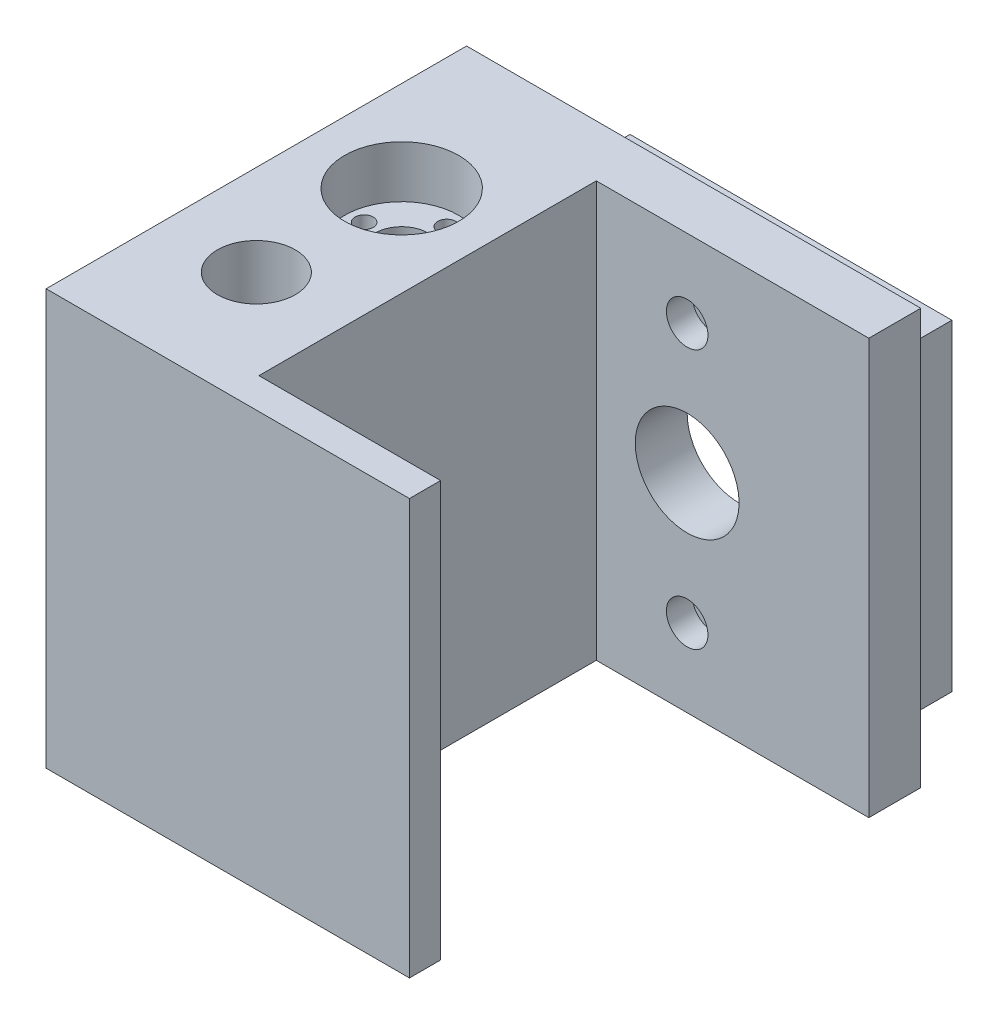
ISO-10303-21;
HEADER;
FILE_DESCRIPTION(('STEP AP214'),'2;1');
FILE_NAME('part.step','',(''),(''),'','','');
FILE_SCHEMA(('AUTOMOTIVE_DESIGN { 1 0 10303 214 1 1 1 1 }'));
ENDSEC;
DATA;
#1=APPLICATION_CONTEXT('core data for automotive mechanical design processes');
#2=APPLICATION_PROTOCOL_DEFINITION('international standard','automotive_design',2000,#1);
#3=PRODUCT_CONTEXT('',#1,'mechanical');
#4=PRODUCT('Part','Part','',(#3));
#5=PRODUCT_RELATED_PRODUCT_CATEGORY('part','',(#4));
#6=PRODUCT_DEFINITION_FORMATION('','',#4);
#7=PRODUCT_DEFINITION_CONTEXT('part definition',#1,'design');
#8=PRODUCT_DEFINITION('design','',#6,#7);
#9=PRODUCT_DEFINITION_SHAPE('','',#8);
#10=(LENGTH_UNIT() NAMED_UNIT(*) SI_UNIT(.MILLI.,.METRE.));
#11=(NAMED_UNIT(*) PLANE_ANGLE_UNIT() SI_UNIT($,.RADIAN.));
#12=(NAMED_UNIT(*) SI_UNIT($,.STERADIAN.) SOLID_ANGLE_UNIT());
#13=UNCERTAINTY_MEASURE_WITH_UNIT(LENGTH_MEASURE(1.E-05),#10,'distance_accuracy_value','');
#14=(GEOMETRIC_REPRESENTATION_CONTEXT(3) GLOBAL_UNCERTAINTY_ASSIGNED_CONTEXT((#13)) GLOBAL_UNIT_ASSIGNED_CONTEXT((#10,
#11,#12)) REPRESENTATION_CONTEXT('',''));
#15=CARTESIAN_POINT('',(0.,0.,0.));
#16=DIRECTION('',(0.,0.,1.));
#17=DIRECTION('',(1.,0.,0.));
#18=AXIS2_PLACEMENT_3D('',#15,#16,#17);
#19=CARTESIAN_POINT('',(0.,168.069574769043,-10.));
#20=DIRECTION('',(0.,0.,1.));
#21=DIRECTION('',(1.,0.,0.));
#22=AXIS2_PLACEMENT_3D('',#19,#20,#21);
#23=PLANE('',#22);
#24=DIRECTION('',(0.,-1.,0.));
#25=VECTOR('',#24,1.);
#26=CARTESIAN_POINT('',(0.,168.069574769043,-10.));
#27=LINE('',#26,#25);
#28=CARTESIAN_POINT('',(0.,80.,-10.));
#29=VERTEX_POINT('',#28);
#30=CARTESIAN_POINT('',(0.,0.,-10.));
#31=VERTEX_POINT('',#30);
#32=EDGE_CURVE('E305',#29,#31,#27,.T.);
#33=ORIENTED_EDGE('',*,*,#32,.F.);
#34=DIRECTION('',(1.,0.,0.));
#35=VECTOR('',#34,1.);
#36=CARTESIAN_POINT('',(0.,80.,-10.));
#37=LINE('',#36,#35);
#38=CARTESIAN_POINT('',(87.5,80.,-10.));
#39=VERTEX_POINT('',#38);
#40=EDGE_CURVE('E296',#29,#39,#37,.T.);
#41=ORIENTED_EDGE('',*,*,#40,.T.);
#42=DIRECTION('',(0.,-1.,0.));
#43=VECTOR('',#42,1.);
#44=CARTESIAN_POINT('',(87.5,168.069574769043,-10.));
#45=LINE('',#44,#43);
#46=CARTESIAN_POINT('',(87.5,0.,-10.));
#47=VERTEX_POINT('',#46);
#48=EDGE_CURVE('E303',#39,#47,#45,.T.);
#49=ORIENTED_EDGE('',*,*,#48,.T.);
#50=DIRECTION('',(-1.,0.,0.));
#51=VECTOR('',#50,1.);
#52=CARTESIAN_POINT('',(0.,0.,-10.));
#53=LINE('',#52,#51);
#54=EDGE_CURVE('E308',#47,#31,#53,.T.);
#55=ORIENTED_EDGE('',*,*,#54,.T.);
#56=EDGE_LOOP('',(#33,#41,#49,#55));
#57=FACE_BOUND('',#56,.T.);
#58=DIRECTION('',(0.,-1.,0.));
#59=VECTOR('',#58,1.);
#60=CARTESIAN_POINT('',(83.5,9.00000000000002,-10.));
#61=LINE('',#60,#59);
#62=CARTESIAN_POINT('',(83.5,71.,-10.));
#63=VERTEX_POINT('',#62);
#64=CARTESIAN_POINT('',(83.5,9.00000000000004,-10.));
#65=VERTEX_POINT('',#64);
#66=EDGE_CURVE('E185',#63,#65,#61,.T.);
#67=ORIENTED_EDGE('',*,*,#66,.F.);
#68=DIRECTION('',(1.,0.,0.));
#69=VECTOR('',#68,1.);
#70=CARTESIAN_POINT('',(83.5,71.,-10.));
#71=LINE('',#70,#69);
#72=CARTESIAN_POINT('',(21.5,71.,-10.));
#73=VERTEX_POINT('',#72);
#74=EDGE_CURVE('E213',#73,#63,#71,.T.);
#75=ORIENTED_EDGE('',*,*,#74,.F.);
#76=DIRECTION('',(0.,1.,0.));
#77=VECTOR('',#76,1.);
#78=CARTESIAN_POINT('',(21.5,71.,-10.));
#79=LINE('',#78,#77);
#80=CARTESIAN_POINT('',(21.5,9.00000000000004,-10.));
#81=VERTEX_POINT('',#80);
#82=EDGE_CURVE('E75',#81,#73,#79,.T.);
#83=ORIENTED_EDGE('',*,*,#82,.F.);
#84=DIRECTION('',(-1.,0.,0.));
#85=VECTOR('',#84,1.);
#86=CARTESIAN_POINT('',(21.5,9.00000000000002,-10.));
#87=LINE('',#86,#85);
#88=EDGE_CURVE('E70',#65,#81,#87,.T.);
#89=ORIENTED_EDGE('',*,*,#88,.F.);
#90=EDGE_LOOP('',(#67,#75,#83,#89));
#91=FACE_BOUND('',#90,.T.);
#92=ADVANCED_FACE('F53',(#57,#91),#23,.F.);
#93=CARTESIAN_POINT('',(35.,0.,65.));
#94=DIRECTION('',(0.,1.,0.));
#95=DIRECTION('',(0.,0.,1.));
#96=AXIS2_PLACEMENT_3D('',#93,#94,#95);
#97=PLANE('',#96);
#98=CARTESIAN_POINT('',(17.5,0.,48.));
#99=DIRECTION('',(0.,1.,0.));
#100=DIRECTION('',(0.,0.,1.));
#101=AXIS2_PLACEMENT_3D('',#98,#99,#100);
#102=CIRCLE('',#101,4.);
#103=CARTESIAN_POINT('',(17.5,0.,52.));
#104=VERTEX_POINT('',#103);
#105=EDGE_CURVE('E236',#104,#104,#102,.T.);
#106=ORIENTED_EDGE('',*,*,#105,.T.);
#107=EDGE_LOOP('',(#106));
#108=FACE_BOUND('',#107,.T.);
#109=CARTESIAN_POINT('',(17.5,0.,20.));
#110=DIRECTION('',(0.,1.,0.));
#111=DIRECTION('',(0.,0.,1.));
#112=AXIS2_PLACEMENT_3D('',#109,#110,#111);
#113=CIRCLE('',#112,5.10000000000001);
#114=CARTESIAN_POINT('',(17.5,0.,25.1));
#115=VERTEX_POINT('',#114);
#116=EDGE_CURVE('E327',#115,#115,#113,.T.);
#117=ORIENTED_EDGE('',*,*,#116,.T.);
#118=EDGE_LOOP('',(#117));
#119=FACE_BOUND('',#118,.T.);
#120=DIRECTION('',(0.,0.,-1.));
#121=VECTOR('',#120,1.);
#122=CARTESIAN_POINT('',(0.,0.,65.));
#123=LINE('',#122,#121);
#124=CARTESIAN_POINT('',(0.,0.,71.));
#125=VERTEX_POINT('',#124);
#126=EDGE_CURVE('E360',#125,#31,#123,.T.);
#127=ORIENTED_EDGE('',*,*,#126,.T.);
#128=ORIENTED_EDGE('',*,*,#54,.F.);
#129=DIRECTION('',(0.,0.,-1.));
#130=VECTOR('',#129,1.);
#131=CARTESIAN_POINT('',(87.5,0.,0.));
#132=LINE('',#131,#130);
#133=CARTESIAN_POINT('',(87.5,0.,0.));
#134=VERTEX_POINT('',#133);
#135=EDGE_CURVE('E311',#134,#47,#132,.T.);
#136=ORIENTED_EDGE('',*,*,#135,.F.);
#137=DIRECTION('',(1.,0.,0.));
#138=VECTOR('',#137,1.);
#139=CARTESIAN_POINT('',(0.,0.,0.));
#140=LINE('',#139,#138);
#141=CARTESIAN_POINT('',(35.,0.,0.));
#142=VERTEX_POINT('',#141);
#143=EDGE_CURVE('E314',#142,#134,#140,.T.);
#144=ORIENTED_EDGE('',*,*,#143,.F.);
#145=DIRECTION('',(0.,0.,-1.));
#146=VECTOR('',#145,1.);
#147=CARTESIAN_POINT('',(35.,0.,65.));
#148=LINE('',#147,#146);
#149=CARTESIAN_POINT('',(35.,0.,65.));
#150=VERTEX_POINT('',#149);
#151=EDGE_CURVE('E364',#150,#142,#148,.T.);
#152=ORIENTED_EDGE('',*,*,#151,.F.);
#153=DIRECTION('',(-1.,0.,0.));
#154=VECTOR('',#153,1.);
#155=CARTESIAN_POINT('',(0.,0.,65.));
#156=LINE('',#155,#154);
#157=CARTESIAN_POINT('',(70.,0.,65.));
#158=VERTEX_POINT('',#157);
#159=EDGE_CURVE('E333',#158,#150,#156,.T.);
#160=ORIENTED_EDGE('',*,*,#159,.F.);
#161=DIRECTION('',(0.,0.,-1.));
#162=VECTOR('',#161,1.);
#163=CARTESIAN_POINT('',(70.,0.,65.));
#164=LINE('',#163,#162);
#165=CARTESIAN_POINT('',(70.,0.,71.));
#166=VERTEX_POINT('',#165);
#167=EDGE_CURVE('E330',#166,#158,#164,.T.);
#168=ORIENTED_EDGE('',*,*,#167,.F.);
#169=DIRECTION('',(1.,0.,0.));
#170=VECTOR('',#169,1.);
#171=CARTESIAN_POINT('',(0.,0.,71.));
#172=LINE('',#171,#170);
#173=EDGE_CURVE('E316',#125,#166,#172,.T.);
#174=ORIENTED_EDGE('',*,*,#173,.F.);
#175=EDGE_LOOP('',(#127,#128,#136,#144,#152,#160,#168,#174));
#176=FACE_BOUND('',#175,.T.);
#177=ADVANCED_FACE('F55',(#108,#119,#176),#97,.F.);
#178=CARTESIAN_POINT('',(35.,80.,65.));
#179=DIRECTION('',(0.,-1.,0.));
#180=DIRECTION('',(0.,0.,-1.));
#181=AXIS2_PLACEMENT_3D('',#178,#179,#180);
#182=PLANE('',#181);
#183=CARTESIAN_POINT('',(17.5,80.,20.));
#184=DIRECTION('',(0.,-1.,0.));
#185=DIRECTION('',(0.,0.,-1.));
#186=AXIS2_PLACEMENT_3D('',#183,#184,#185);
#187=CIRCLE('',#186,11.);
#188=CARTESIAN_POINT('',(17.5,80.,9.00000000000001));
#189=VERTEX_POINT('',#188);
#190=EDGE_CURVE('E348',#189,#189,#187,.T.);
#191=ORIENTED_EDGE('',*,*,#190,.T.);
#192=EDGE_LOOP('',(#191));
#193=FACE_BOUND('',#192,.T.);
#194=CARTESIAN_POINT('',(17.5,80.,48.));
#195=DIRECTION('',(0.,-1.,0.));
#196=DIRECTION('',(0.,0.,-1.));
#197=AXIS2_PLACEMENT_3D('',#194,#195,#196);
#198=CIRCLE('',#197,7.5);
#199=CARTESIAN_POINT('',(17.5,80.,40.5));
#200=VERTEX_POINT('',#199);
#201=EDGE_CURVE('E352',#200,#200,#198,.T.);
#202=ORIENTED_EDGE('',*,*,#201,.T.);
#203=EDGE_LOOP('',(#202));
#204=FACE_BOUND('',#203,.T.);
#205=DIRECTION('',(0.,0.,1.));
#206=VECTOR('',#205,1.);
#207=CARTESIAN_POINT('',(0.,80.,65.));
#208=LINE('',#207,#206);
#209=CARTESIAN_POINT('',(0.,80.,71.));
#210=VERTEX_POINT('',#209);
#211=EDGE_CURVE('E365',#29,#210,#208,.T.);
#212=ORIENTED_EDGE('',*,*,#211,.T.);
#213=DIRECTION('',(-1.,0.,0.));
#214=VECTOR('',#213,1.);
#215=CARTESIAN_POINT('',(0.,80.,71.));
#216=LINE('',#215,#214);
#217=CARTESIAN_POINT('',(70.,80.,71.));
#218=VERTEX_POINT('',#217);
#219=EDGE_CURVE('E323',#218,#210,#216,.T.);
#220=ORIENTED_EDGE('',*,*,#219,.F.);
#221=DIRECTION('',(0.,0.,1.));
#222=VECTOR('',#221,1.);
#223=CARTESIAN_POINT('',(70.,80.,65.));
#224=LINE('',#223,#222);
#225=CARTESIAN_POINT('',(70.,80.,65.));
#226=VERTEX_POINT('',#225);
#227=EDGE_CURVE('E320',#226,#218,#224,.T.);
#228=ORIENTED_EDGE('',*,*,#227,.F.);
#229=DIRECTION('',(1.,0.,0.));
#230=VECTOR('',#229,1.);
#231=CARTESIAN_POINT('',(0.,80.,65.));
#232=LINE('',#231,#230);
#233=CARTESIAN_POINT('',(35.,80.,65.));
#234=VERTEX_POINT('',#233);
#235=EDGE_CURVE('E324',#234,#226,#232,.T.);
#236=ORIENTED_EDGE('',*,*,#235,.F.);
#237=DIRECTION('',(0.,0.,1.));
#238=VECTOR('',#237,1.);
#239=CARTESIAN_POINT('',(35.,80.,65.));
#240=LINE('',#239,#238);
#241=CARTESIAN_POINT('',(35.,80.,0.));
#242=VERTEX_POINT('',#241);
#243=EDGE_CURVE('E13',#242,#234,#240,.T.);
#244=ORIENTED_EDGE('',*,*,#243,.F.);
#245=DIRECTION('',(-1.,0.,0.));
#246=VECTOR('',#245,1.);
#247=CARTESIAN_POINT('',(0.,80.,0.));
#248=LINE('',#247,#246);
#249=CARTESIAN_POINT('',(87.5,80.,0.));
#250=VERTEX_POINT('',#249);
#251=EDGE_CURVE('E295',#250,#242,#248,.T.);
#252=ORIENTED_EDGE('',*,*,#251,.F.);
#253=DIRECTION('',(0.,0.,1.));
#254=VECTOR('',#253,1.);
#255=CARTESIAN_POINT('',(87.5,80.,0.));
#256=LINE('',#255,#254);
#257=EDGE_CURVE('E300',#39,#250,#256,.T.);
#258=ORIENTED_EDGE('',*,*,#257,.F.);
#259=ORIENTED_EDGE('',*,*,#40,.F.);
#260=EDGE_LOOP('',(#212,#220,#228,#236,#244,#252,#258,#259));
#261=FACE_BOUND('',#260,.T.);
#262=ADVANCED_FACE('F411',(#193,#204,#261),#182,.F.);
#263=CARTESIAN_POINT('',(35.,0.,0.));
#264=DIRECTION('',(1.,0.,0.));
#265=DIRECTION('',(0.,0.,-1.));
#266=AXIS2_PLACEMENT_3D('',#263,#264,#265);
#267=PLANE('',#266);
#268=DIRECTION('',(0.,-1.,0.));
#269=VECTOR('',#268,1.);
#270=CARTESIAN_POINT('',(35.,80.,65.));
#271=LINE('',#270,#269);
#272=EDGE_CURVE('E361',#234,#150,#271,.T.);
#273=ORIENTED_EDGE('',*,*,#272,.T.);
#274=ORIENTED_EDGE('',*,*,#151,.T.);
#275=DIRECTION('',(0.,1.,0.));
#276=VECTOR('',#275,1.);
#277=CARTESIAN_POINT('',(35.,80.,0.));
#278=LINE('',#277,#276);
#279=EDGE_CURVE('E62',#142,#242,#278,.T.);
#280=ORIENTED_EDGE('',*,*,#279,.T.);
#281=ORIENTED_EDGE('',*,*,#243,.T.);
#282=EDGE_LOOP('',(#273,#274,#280,#281));
#283=FACE_BOUND('',#282,.T.);
#284=ADVANCED_FACE('F499',(#283),#267,.T.);
#285=CARTESIAN_POINT('',(0.,0.,0.));
#286=DIRECTION('',(1.,0.,0.));
#287=DIRECTION('',(0.,0.,-1.));
#288=AXIS2_PLACEMENT_3D('',#285,#286,#287);
#289=PLANE('',#288);
#290=ORIENTED_EDGE('',*,*,#126,.F.);
#291=DIRECTION('',(0.,-1.,0.));
#292=VECTOR('',#291,1.);
#293=CARTESIAN_POINT('',(0.,168.069574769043,71.));
#294=LINE('',#293,#292);
#295=EDGE_CURVE('E339',#210,#125,#294,.T.);
#296=ORIENTED_EDGE('',*,*,#295,.F.);
#297=ORIENTED_EDGE('',*,*,#211,.F.);
#298=ORIENTED_EDGE('',*,*,#32,.T.);
#299=EDGE_LOOP('',(#290,#296,#297,#298));
#300=FACE_BOUND('',#299,.T.);
#301=ADVANCED_FACE('F510',(#300),#289,.F.);
#302=CARTESIAN_POINT('',(17.5,-21.2132034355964,48.));
#303=DIRECTION('',(0.,1.,0.));
#304=DIRECTION('',(0.,0.,1.));
#305=AXIS2_PLACEMENT_3D('',#302,#303,#304);
#306=CYLINDRICAL_SURFACE('',#305,7.5);
#307=CARTESIAN_POINT('',(17.5,5.,48.));
#308=DIRECTION('',(0.,1.,0.));
#309=DIRECTION('',(0.,0.,1.));
#310=AXIS2_PLACEMENT_3D('',#307,#308,#309);
#311=CIRCLE('',#310,7.5);
#312=CARTESIAN_POINT('',(17.5,5.,55.5));
#313=VERTEX_POINT('',#312);
#314=EDGE_CURVE('E357',#313,#313,#311,.T.);
#315=ORIENTED_EDGE('',*,*,#314,.F.);
#316=EDGE_LOOP('',(#315));
#317=FACE_BOUND('',#316,.T.);
#318=ORIENTED_EDGE('',*,*,#201,.F.);
#319=EDGE_LOOP('',(#318));
#320=FACE_BOUND('',#319,.T.);
#321=ADVANCED_FACE('F534',(#317,#320),#306,.F.);
#322=CARTESIAN_POINT('',(35.,5.,65.));
#323=DIRECTION('',(0.,1.,0.));
#324=DIRECTION('',(0.,0.,1.));
#325=AXIS2_PLACEMENT_3D('',#322,#323,#324);
#326=PLANE('',#325);
#327=CARTESIAN_POINT('',(17.5,5.,48.));
#328=DIRECTION('',(0.,1.,0.));
#329=DIRECTION('',(0.,0.,1.));
#330=AXIS2_PLACEMENT_3D('',#327,#328,#329);
#331=CIRCLE('',#330,4.);
#332=CARTESIAN_POINT('',(17.5,5.,52.));
#333=VERTEX_POINT('',#332);
#334=EDGE_CURVE('E57',#333,#333,#331,.T.);
#335=ORIENTED_EDGE('',*,*,#334,.F.);
#336=EDGE_LOOP('',(#335));
#337=FACE_BOUND('',#336,.T.);
#338=ORIENTED_EDGE('',*,*,#314,.T.);
#339=EDGE_LOOP('',(#338));
#340=FACE_BOUND('',#339,.T.);
#341=ADVANCED_FACE('F527',(#337,#340),#326,.T.);
#342=CARTESIAN_POINT('',(17.5,70.,20.));
#343=DIRECTION('',(0.,-1.,0.));
#344=DIRECTION('',(0.,0.,-1.));
#345=AXIS2_PLACEMENT_3D('',#342,#343,#344);
#346=PLANE('',#345);
#347=CARTESIAN_POINT('',(16.7739426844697,70.,27.9669844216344));
#348=DIRECTION('',(0.,1.,0.));
#349=DIRECTION('',(0.,0.,1.));
#350=AXIS2_PLACEMENT_3D('',#347,#348,#349);
#351=CIRCLE('',#350,1.75);
#352=CARTESIAN_POINT('',(16.7739426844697,70.,29.7169844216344));
#353=VERTEX_POINT('',#352);
#354=EDGE_CURVE('E250',#353,#353,#351,.T.);
#355=ORIENTED_EDGE('',*,*,#354,.F.);
#356=EDGE_LOOP('',(#355));
#357=FACE_BOUND('',#356,.T.);
#358=CARTESIAN_POINT('',(9.53301557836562,70.,19.2739426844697));
#359=DIRECTION('',(0.,1.,0.));
#360=DIRECTION('',(0.,0.,1.));
#361=AXIS2_PLACEMENT_3D('',#358,#359,#360);
#362=CIRCLE('',#361,1.75);
#363=CARTESIAN_POINT('',(9.53301557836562,70.,21.0239426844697));
#364=VERTEX_POINT('',#363);
#365=EDGE_CURVE('E253',#364,#364,#362,.T.);
#366=ORIENTED_EDGE('',*,*,#365,.F.);
#367=EDGE_LOOP('',(#366));
#368=FACE_BOUND('',#367,.T.);
#369=CARTESIAN_POINT('',(18.2260573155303,70.,12.0330155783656));
#370=DIRECTION('',(0.,1.,0.));
#371=DIRECTION('',(0.,0.,1.));
#372=AXIS2_PLACEMENT_3D('',#369,#370,#371);
#373=CIRCLE('',#372,1.75);
#374=CARTESIAN_POINT('',(18.2260573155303,70.,13.7830155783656));
#375=VERTEX_POINT('',#374);
#376=EDGE_CURVE('E259',#375,#375,#373,.T.);
#377=ORIENTED_EDGE('',*,*,#376,.F.);
#378=EDGE_LOOP('',(#377));
#379=FACE_BOUND('',#378,.T.);
#380=CARTESIAN_POINT('',(25.4669844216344,70.,20.7260573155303));
#381=DIRECTION('',(0.,1.,0.));
#382=DIRECTION('',(0.,0.,1.));
#383=AXIS2_PLACEMENT_3D('',#380,#381,#382);
#384=CIRCLE('',#383,1.75);
#385=CARTESIAN_POINT('',(25.4669844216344,70.,22.4760573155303));
#386=VERTEX_POINT('',#385);
#387=EDGE_CURVE('E265',#386,#386,#384,.T.);
#388=ORIENTED_EDGE('',*,*,#387,.F.);
#389=EDGE_LOOP('',(#388));
#390=FACE_BOUND('',#389,.T.);
#391=CARTESIAN_POINT('',(17.5,70.,20.));
#392=DIRECTION('',(0.,-1.,0.));
#393=DIRECTION('',(0.,0.,-1.));
#394=AXIS2_PLACEMENT_3D('',#391,#392,#393);
#395=CIRCLE('',#394,11.);
#396=CARTESIAN_POINT('',(17.5,70.,9.00000000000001));
#397=VERTEX_POINT('',#396);
#398=EDGE_CURVE('E349',#397,#397,#395,.T.);
#399=ORIENTED_EDGE('',*,*,#398,.F.);
#400=EDGE_LOOP('',(#399));
#401=FACE_BOUND('',#400,.T.);
#402=CARTESIAN_POINT('',(17.5,70.,20.));
#403=DIRECTION('',(0.,-1.,0.));
#404=DIRECTION('',(0.,0.,-1.));
#405=AXIS2_PLACEMENT_3D('',#402,#403,#404);
#406=CIRCLE('',#405,5.10000000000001);
#407=CARTESIAN_POINT('',(17.5,70.,14.9));
#408=VERTEX_POINT('',#407);
#409=EDGE_CURVE('E345',#408,#408,#406,.T.);
#410=ORIENTED_EDGE('',*,*,#409,.T.);
#411=EDGE_LOOP('',(#410));
#412=FACE_BOUND('',#411,.T.);
#413=ADVANCED_FACE('F524',(#357,#368,#379,#390,#401,#412),#346,.F.);
#414=CARTESIAN_POINT('',(17.5,70.,20.));
#415=DIRECTION('',(0.,1.,0.));
#416=DIRECTION('',(0.,0.,1.));
#417=AXIS2_PLACEMENT_3D('',#414,#415,#416);
#418=CYLINDRICAL_SURFACE('',#417,11.);
#419=ORIENTED_EDGE('',*,*,#398,.T.);
#420=EDGE_LOOP('',(#419));
#421=FACE_BOUND('',#420,.T.);
#422=ORIENTED_EDGE('',*,*,#190,.F.);
#423=EDGE_LOOP('',(#422));
#424=FACE_BOUND('',#423,.T.);
#425=ADVANCED_FACE('F522',(#421,#424),#418,.F.);
#426=CARTESIAN_POINT('',(17.5,0.,20.));
#427=DIRECTION('',(0.,1.,0.));
#428=DIRECTION('',(0.,0.,1.));
#429=AXIS2_PLACEMENT_3D('',#426,#427,#428);
#430=CYLINDRICAL_SURFACE('',#429,5.10000000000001);
#431=ORIENTED_EDGE('',*,*,#116,.F.);
#432=EDGE_LOOP('',(#431));
#433=FACE_BOUND('',#432,.T.);
#434=ORIENTED_EDGE('',*,*,#409,.F.);
#435=EDGE_LOOP('',(#434));
#436=FACE_BOUND('',#435,.T.);
#437=ADVANCED_FACE('F486',(#433,#436),#430,.F.);
#438=CARTESIAN_POINT('',(0.,168.069574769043,65.));
#439=DIRECTION('',(0.,0.,1.));
#440=DIRECTION('',(1.,0.,0.));
#441=AXIS2_PLACEMENT_3D('',#438,#439,#440);
#442=PLANE('',#441);
#443=CARTESIAN_POINT('',(52.5,65.,65.));
#444=DIRECTION('',(0.,0.,1.));
#445=DIRECTION('',(1.,0.,0.));
#446=AXIS2_PLACEMENT_3D('',#443,#444,#445);
#447=CIRCLE('',#446,4.00000000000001);
#448=CARTESIAN_POINT('',(56.5,65.,65.));
#449=VERTEX_POINT('',#448);
#450=EDGE_CURVE('E292',#449,#449,#447,.T.);
#451=ORIENTED_EDGE('',*,*,#450,.T.);
#452=EDGE_LOOP('',(#451));
#453=FACE_BOUND('',#452,.T.);
#454=CARTESIAN_POINT('',(52.5,15.,65.));
#455=DIRECTION('',(0.,0.,1.));
#456=DIRECTION('',(1.,0.,0.));
#457=AXIS2_PLACEMENT_3D('',#454,#455,#456);
#458=CIRCLE('',#457,4.00000000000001);
#459=CARTESIAN_POINT('',(56.5,15.,65.));
#460=VERTEX_POINT('',#459);
#461=EDGE_CURVE('E288',#460,#460,#458,.T.);
#462=ORIENTED_EDGE('',*,*,#461,.T.);
#463=EDGE_LOOP('',(#462));
#464=FACE_BOUND('',#463,.T.);
#465=CARTESIAN_POINT('',(52.5,40.,65.));
#466=DIRECTION('',(0.,0.,1.));
#467=DIRECTION('',(1.,0.,0.));
#468=AXIS2_PLACEMENT_3D('',#465,#466,#467);
#469=CIRCLE('',#468,5.1);
#470=CARTESIAN_POINT('',(57.6,40.,65.));
#471=VERTEX_POINT('',#470);
#472=EDGE_CURVE('E277',#471,#471,#469,.T.);
#473=ORIENTED_EDGE('',*,*,#472,.T.);
#474=EDGE_LOOP('',(#473));
#475=FACE_BOUND('',#474,.T.);
#476=ORIENTED_EDGE('',*,*,#272,.F.);
#477=ORIENTED_EDGE('',*,*,#235,.T.);
#478=DIRECTION('',(0.,-1.,0.));
#479=VECTOR('',#478,1.);
#480=CARTESIAN_POINT('',(70.,168.069574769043,65.));
#481=LINE('',#480,#479);
#482=EDGE_CURVE('E335',#226,#158,#481,.T.);
#483=ORIENTED_EDGE('',*,*,#482,.T.);
#484=ORIENTED_EDGE('',*,*,#159,.T.);
#485=EDGE_LOOP('',(#476,#477,#483,#484));
#486=FACE_BOUND('',#485,.T.);
#487=ADVANCED_FACE('F483',(#453,#464,#475,#486),#442,.F.);
#488=CARTESIAN_POINT('',(70.,168.069574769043,65.));
#489=DIRECTION('',(-1.,0.,0.));
#490=DIRECTION('',(0.,0.,1.));
#491=AXIS2_PLACEMENT_3D('',#488,#489,#490);
#492=PLANE('',#491);
#493=ORIENTED_EDGE('',*,*,#482,.F.);
#494=ORIENTED_EDGE('',*,*,#227,.T.);
#495=DIRECTION('',(0.,-1.,0.));
#496=VECTOR('',#495,1.);
#497=CARTESIAN_POINT('',(70.,168.069574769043,71.));
#498=LINE('',#497,#496);
#499=EDGE_CURVE('E337',#218,#166,#498,.T.);
#500=ORIENTED_EDGE('',*,*,#499,.T.);
#501=ORIENTED_EDGE('',*,*,#167,.T.);
#502=EDGE_LOOP('',(#493,#494,#500,#501));
#503=FACE_BOUND('',#502,.T.);
#504=ADVANCED_FACE('F425',(#503),#492,.F.);
#505=CARTESIAN_POINT('',(0.,168.069574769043,71.));
#506=DIRECTION('',(0.,0.,-1.));
#507=DIRECTION('',(-1.,0.,0.));
#508=AXIS2_PLACEMENT_3D('',#505,#506,#507);
#509=PLANE('',#508);
#510=ORIENTED_EDGE('',*,*,#499,.F.);
#511=ORIENTED_EDGE('',*,*,#219,.T.);
#512=ORIENTED_EDGE('',*,*,#295,.T.);
#513=ORIENTED_EDGE('',*,*,#173,.T.);
#514=EDGE_LOOP('',(#510,#511,#512,#513));
#515=FACE_BOUND('',#514,.T.);
#516=ADVANCED_FACE('F417',(#515),#509,.F.);
#517=DIRECTION('',(1.,0.,0.));
#518=VECTOR('',#517,1.);
#519=CARTESIAN_POINT('',(80.5,68.,-10.));
#520=LINE('',#519,#518);
#521=CARTESIAN_POINT('',(24.5,68.,-10.));
#522=VERTEX_POINT('',#521);
#523=CARTESIAN_POINT('',(80.5,68.,-10.));
#524=VERTEX_POINT('',#523);
#525=EDGE_CURVE('E178',#522,#524,#520,.T.);
#526=ORIENTED_EDGE('',*,*,#525,.T.);
#527=DIRECTION('',(0.,-1.,0.));
#528=VECTOR('',#527,1.);
#529=CARTESIAN_POINT('',(80.5,12.,-10.));
#530=LINE('',#529,#528);
#531=CARTESIAN_POINT('',(80.5,12.,-10.));
#532=VERTEX_POINT('',#531);
#533=EDGE_CURVE('E197',#524,#532,#530,.T.);
#534=ORIENTED_EDGE('',*,*,#533,.T.);
#535=DIRECTION('',(-1.,0.,0.));
#536=VECTOR('',#535,1.);
#537=CARTESIAN_POINT('',(24.5,12.,-10.));
#538=LINE('',#537,#536);
#539=CARTESIAN_POINT('',(24.5,12.,-10.));
#540=VERTEX_POINT('',#539);
#541=EDGE_CURVE('E184',#532,#540,#538,.T.);
#542=ORIENTED_EDGE('',*,*,#541,.T.);
#543=DIRECTION('',(0.,1.,0.));
#544=VECTOR('',#543,1.);
#545=CARTESIAN_POINT('',(24.5,68.,-10.));
#546=LINE('',#545,#544);
#547=EDGE_CURVE('E200',#540,#522,#546,.T.);
#548=ORIENTED_EDGE('',*,*,#547,.T.);
#549=EDGE_LOOP('',(#526,#534,#542,#548));
#550=FACE_BOUND('',#549,.T.);
#551=CARTESIAN_POINT('',(52.5,40.,-10.));
#552=DIRECTION('',(0.,0.,-1.));
#553=DIRECTION('',(-1.,0.,0.));
#554=AXIS2_PLACEMENT_3D('',#551,#552,#553);
#555=CIRCLE('',#554,10.);
#556=CARTESIAN_POINT('',(42.5,40.,-10.));
#557=VERTEX_POINT('',#556);
#558=EDGE_CURVE('E239',#557,#557,#555,.T.);
#559=ORIENTED_EDGE('',*,*,#558,.F.);
#560=EDGE_LOOP('',(#559));
#561=FACE_BOUND('',#560,.T.);
#562=ADVANCED_FACE('F405',(#550,#561),#23,.F.);
#563=CARTESIAN_POINT('',(87.5,168.069574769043,0.));
#564=DIRECTION('',(-1.,0.,0.));
#565=DIRECTION('',(0.,0.,1.));
#566=AXIS2_PLACEMENT_3D('',#563,#564,#565);
#567=PLANE('',#566);
#568=ORIENTED_EDGE('',*,*,#48,.F.);
#569=ORIENTED_EDGE('',*,*,#257,.T.);
#570=DIRECTION('',(0.,-1.,0.));
#571=VECTOR('',#570,1.);
#572=CARTESIAN_POINT('',(87.5,168.069574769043,0.));
#573=LINE('',#572,#571);
#574=EDGE_CURVE('E299',#250,#134,#573,.T.);
#575=ORIENTED_EDGE('',*,*,#574,.T.);
#576=ORIENTED_EDGE('',*,*,#135,.T.);
#577=EDGE_LOOP('',(#568,#569,#575,#576));
#578=FACE_BOUND('',#577,.T.);
#579=ADVANCED_FACE('F416',(#578),#567,.F.);
#580=CARTESIAN_POINT('',(0.,168.069574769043,0.));
#581=DIRECTION('',(0.,0.,-1.));
#582=DIRECTION('',(-1.,0.,0.));
#583=AXIS2_PLACEMENT_3D('',#580,#581,#582);
#584=PLANE('',#583);
#585=CARTESIAN_POINT('',(52.5,40.,0.));
#586=DIRECTION('',(0.,0.,-1.));
#587=DIRECTION('',(-1.,0.,0.));
#588=AXIS2_PLACEMENT_3D('',#585,#586,#587);
#589=CIRCLE('',#588,10.);
#590=CARTESIAN_POINT('',(42.5,40.,0.));
#591=VERTEX_POINT('',#590);
#592=EDGE_CURVE('E242',#591,#591,#589,.F.);
#593=ORIENTED_EDGE('',*,*,#592,.F.);
#594=EDGE_LOOP('',(#593));
#595=FACE_BOUND('',#594,.T.);
#596=CARTESIAN_POINT('',(52.5,65.,0.));
#597=DIRECTION('',(0.,0.,-1.));
#598=DIRECTION('',(-1.,0.,0.));
#599=AXIS2_PLACEMENT_3D('',#596,#597,#598);
#600=CIRCLE('',#599,4.00000000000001);
#601=CARTESIAN_POINT('',(48.5,65.,0.));
#602=VERTEX_POINT('',#601);
#603=EDGE_CURVE('E291',#602,#602,#600,.T.);
#604=ORIENTED_EDGE('',*,*,#603,.T.);
#605=EDGE_LOOP('',(#604));
#606=FACE_BOUND('',#605,.T.);
#607=CARTESIAN_POINT('',(52.5,15.,0.));
#608=DIRECTION('',(0.,0.,-1.));
#609=DIRECTION('',(-1.,0.,0.));
#610=AXIS2_PLACEMENT_3D('',#607,#608,#609);
#611=CIRCLE('',#610,4.00000000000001);
#612=CARTESIAN_POINT('',(48.5,15.,0.));
#613=VERTEX_POINT('',#612);
#614=EDGE_CURVE('E287',#613,#613,#611,.T.);
#615=ORIENTED_EDGE('',*,*,#614,.T.);
#616=EDGE_LOOP('',(#615));
#617=FACE_BOUND('',#616,.T.);
#618=ORIENTED_EDGE('',*,*,#279,.F.);
#619=ORIENTED_EDGE('',*,*,#143,.T.);
#620=ORIENTED_EDGE('',*,*,#574,.F.);
#621=ORIENTED_EDGE('',*,*,#251,.T.);
#622=EDGE_LOOP('',(#618,#619,#620,#621));
#623=FACE_BOUND('',#622,.T.);
#624=ADVANCED_FACE('F376',(#595,#606,#617,#623),#584,.F.);
#625=CARTESIAN_POINT('',(0.,168.069574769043,-5.));
#626=DIRECTION('',(0.,0.,1.));
#627=DIRECTION('',(1.,0.,0.));
#628=AXIS2_PLACEMENT_3D('',#625,#626,#627);
#629=PLANE('',#628);
#630=CARTESIAN_POINT('',(52.5,15.,-5.));
#631=DIRECTION('',(0.,0.,1.));
#632=DIRECTION('',(1.,0.,0.));
#633=AXIS2_PLACEMENT_3D('',#630,#631,#632);
#634=CIRCLE('',#633,4.00000000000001);
#635=CARTESIAN_POINT('',(56.5,15.,-5.));
#636=VERTEX_POINT('',#635);
#637=EDGE_CURVE('E278',#636,#636,#634,.F.);
#638=ORIENTED_EDGE('',*,*,#637,.F.);
#639=EDGE_LOOP('',(#638));
#640=FACE_BOUND('',#639,.T.);
#641=ADVANCED_FACE('F597',(#640),#629,.T.);
#642=CARTESIAN_POINT('',(52.5,15.,-24.4249783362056));
#643=DIRECTION('',(0.,0.,1.));
#644=DIRECTION('',(1.,0.,0.));
#645=AXIS2_PLACEMENT_3D('',#642,#643,#644);
#646=CYLINDRICAL_SURFACE('',#645,4.00000000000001);
#647=ORIENTED_EDGE('',*,*,#637,.T.);
#648=EDGE_LOOP('',(#647));
#649=FACE_BOUND('',#648,.T.);
#650=ORIENTED_EDGE('',*,*,#614,.F.);
#651=EDGE_LOOP('',(#650));
#652=FACE_BOUND('',#651,.T.);
#653=ADVANCED_FACE('F393',(#649,#652),#646,.F.);
#654=CARTESIAN_POINT('',(0.,168.069574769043,-5.));
#655=DIRECTION('',(0.,0.,1.));
#656=DIRECTION('',(1.,0.,0.));
#657=AXIS2_PLACEMENT_3D('',#654,#655,#656);
#658=PLANE('',#657);
#659=CARTESIAN_POINT('',(52.5,65.,-5.));
#660=DIRECTION('',(0.,0.,1.));
#661=DIRECTION('',(1.,0.,0.));
#662=AXIS2_PLACEMENT_3D('',#659,#660,#661);
#663=CIRCLE('',#662,4.00000000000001);
#664=CARTESIAN_POINT('',(56.5,65.,-5.));
#665=VERTEX_POINT('',#664);
#666=EDGE_CURVE('E273',#665,#665,#663,.F.);
#667=ORIENTED_EDGE('',*,*,#666,.F.);
#668=EDGE_LOOP('',(#667));
#669=FACE_BOUND('',#668,.T.);
#670=ADVANCED_FACE('F382',(#669),#658,.T.);
#671=CARTESIAN_POINT('',(52.5,65.,-24.4249783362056));
#672=DIRECTION('',(0.,0.,1.));
#673=DIRECTION('',(1.,0.,0.));
#674=AXIS2_PLACEMENT_3D('',#671,#672,#673);
#675=CYLINDRICAL_SURFACE('',#674,4.00000000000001);
#676=ORIENTED_EDGE('',*,*,#666,.T.);
#677=EDGE_LOOP('',(#676));
#678=FACE_BOUND('',#677,.T.);
#679=ORIENTED_EDGE('',*,*,#603,.F.);
#680=EDGE_LOOP('',(#679));
#681=FACE_BOUND('',#680,.T.);
#682=ADVANCED_FACE('F379',(#678,#681),#675,.F.);
#683=CARTESIAN_POINT('',(52.5,40.,-24.4249783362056));
#684=DIRECTION('',(0.,0.,1.));
#685=DIRECTION('',(1.,0.,0.));
#686=AXIS2_PLACEMENT_3D('',#683,#684,#685);
#687=CYLINDRICAL_SURFACE('',#686,5.1);
#688=CARTESIAN_POINT('',(52.5,40.,66.));
#689=DIRECTION('',(0.,0.,1.));
#690=DIRECTION('',(1.,0.,0.));
#691=AXIS2_PLACEMENT_3D('',#688,#689,#690);
#692=CIRCLE('',#691,5.1);
#693=CARTESIAN_POINT('',(57.6,40.,66.));
#694=VERTEX_POINT('',#693);
#695=EDGE_CURVE('E249',#694,#694,#692,.T.);
#696=ORIENTED_EDGE('',*,*,#695,.T.);
#697=EDGE_LOOP('',(#696));
#698=FACE_BOUND('',#697,.T.);
#699=ORIENTED_EDGE('',*,*,#472,.F.);
#700=EDGE_LOOP('',(#699));
#701=FACE_BOUND('',#700,.T.);
#702=ADVANCED_FACE('F381',(#698,#701),#687,.F.);
#703=CARTESIAN_POINT('',(52.5,40.,66.));
#704=DIRECTION('',(0.,0.,1.));
#705=DIRECTION('',(1.,0.,0.));
#706=AXIS2_PLACEMENT_3D('',#703,#704,#705);
#707=PLANE('',#706);
#708=ORIENTED_EDGE('',*,*,#695,.F.);
#709=EDGE_LOOP('',(#708));
#710=FACE_BOUND('',#709,.T.);
#711=ADVANCED_FACE('F390',(#710),#707,.F.);
#712=CARTESIAN_POINT('',(52.5,15.,66.));
#713=DIRECTION('',(0.,0.,1.));
#714=DIRECTION('',(1.,0.,0.));
#715=AXIS2_PLACEMENT_3D('',#712,#713,#714);
#716=CIRCLE('',#715,4.00000000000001);
#717=CARTESIAN_POINT('',(56.5,15.,66.));
#718=VERTEX_POINT('',#717);
#719=EDGE_CURVE('E274',#718,#718,#716,.T.);
#720=ORIENTED_EDGE('',*,*,#719,.T.);
#721=EDGE_LOOP('',(#720));
#722=FACE_BOUND('',#721,.T.);
#723=ORIENTED_EDGE('',*,*,#461,.F.);
#724=EDGE_LOOP('',(#723));
#725=FACE_BOUND('',#724,.T.);
#726=ADVANCED_FACE('F615',(#722,#725),#646,.F.);
#727=CARTESIAN_POINT('',(52.5,15.,66.));
#728=DIRECTION('',(0.,0.,1.));
#729=DIRECTION('',(1.,0.,0.));
#730=AXIS2_PLACEMENT_3D('',#727,#728,#729);
#731=PLANE('',#730);
#732=ORIENTED_EDGE('',*,*,#719,.F.);
#733=EDGE_LOOP('',(#732));
#734=FACE_BOUND('',#733,.T.);
#735=ADVANCED_FACE('F400',(#734),#731,.F.);
#736=CARTESIAN_POINT('',(52.5,65.,66.));
#737=DIRECTION('',(0.,0.,1.));
#738=DIRECTION('',(1.,0.,0.));
#739=AXIS2_PLACEMENT_3D('',#736,#737,#738);
#740=CIRCLE('',#739,4.00000000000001);
#741=CARTESIAN_POINT('',(56.5,65.,66.));
#742=VERTEX_POINT('',#741);
#743=EDGE_CURVE('E270',#742,#742,#740,.T.);
#744=ORIENTED_EDGE('',*,*,#743,.T.);
#745=EDGE_LOOP('',(#744));
#746=FACE_BOUND('',#745,.T.);
#747=ORIENTED_EDGE('',*,*,#450,.F.);
#748=EDGE_LOOP('',(#747));
#749=FACE_BOUND('',#748,.T.);
#750=ADVANCED_FACE('F385',(#746,#749),#675,.F.);
#751=CARTESIAN_POINT('',(52.5,65.,66.));
#752=DIRECTION('',(0.,0.,1.));
#753=DIRECTION('',(1.,0.,0.));
#754=AXIS2_PLACEMENT_3D('',#751,#752,#753);
#755=PLANE('',#754);
#756=ORIENTED_EDGE('',*,*,#743,.F.);
#757=EDGE_LOOP('',(#756));
#758=FACE_BOUND('',#757,.T.);
#759=ADVANCED_FACE('F399',(#758),#755,.F.);
#760=CARTESIAN_POINT('',(25.4669844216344,60.,20.7260573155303));
#761=DIRECTION('',(0.,1.,0.));
#762=DIRECTION('',(0.,0.,1.));
#763=AXIS2_PLACEMENT_3D('',#760,#761,#762);
#764=CYLINDRICAL_SURFACE('',#763,1.75);
#765=CARTESIAN_POINT('',(25.4669844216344,60.,20.7260573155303));
#766=DIRECTION('',(0.,1.,0.));
#767=DIRECTION('',(0.,0.,1.));
#768=AXIS2_PLACEMENT_3D('',#765,#766,#767);
#769=CIRCLE('',#768,1.75);
#770=CARTESIAN_POINT('',(25.4669844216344,60.,22.4760573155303));
#771=VERTEX_POINT('',#770);
#772=EDGE_CURVE('E245',#771,#771,#769,.T.);
#773=ORIENTED_EDGE('',*,*,#772,.F.);
#774=EDGE_LOOP('',(#773));
#775=FACE_BOUND('',#774,.T.);
#776=ORIENTED_EDGE('',*,*,#387,.T.);
#777=EDGE_LOOP('',(#776));
#778=FACE_BOUND('',#777,.T.);
#779=ADVANCED_FACE('F469',(#775,#778),#764,.F.);
#780=CARTESIAN_POINT('',(25.4669844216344,60.,20.7260573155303));
#781=DIRECTION('',(0.,1.,0.));
#782=DIRECTION('',(0.,0.,1.));
#783=AXIS2_PLACEMENT_3D('',#780,#781,#782);
#784=PLANE('',#783);
#785=ORIENTED_EDGE('',*,*,#772,.T.);
#786=EDGE_LOOP('',(#785));
#787=FACE_BOUND('',#786,.T.);
#788=ADVANCED_FACE('F464',(#787),#784,.T.);
#789=CARTESIAN_POINT('',(18.2260573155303,60.,12.0330155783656));
#790=DIRECTION('',(0.,1.,0.));
#791=DIRECTION('',(0.,0.,1.));
#792=AXIS2_PLACEMENT_3D('',#789,#790,#791);
#793=CYLINDRICAL_SURFACE('',#792,1.75);
#794=CARTESIAN_POINT('',(18.2260573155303,60.,12.0330155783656));
#795=DIRECTION('',(0.,1.,0.));
#796=DIRECTION('',(0.,0.,1.));
#797=AXIS2_PLACEMENT_3D('',#794,#795,#796);
#798=CIRCLE('',#797,1.75);
#799=CARTESIAN_POINT('',(18.2260573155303,60.,13.7830155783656));
#800=VERTEX_POINT('',#799);
#801=EDGE_CURVE('E262',#800,#800,#798,.T.);
#802=ORIENTED_EDGE('',*,*,#801,.F.);
#803=EDGE_LOOP('',(#802));
#804=FACE_BOUND('',#803,.T.);
#805=ORIENTED_EDGE('',*,*,#376,.T.);
#806=EDGE_LOOP('',(#805));
#807=FACE_BOUND('',#806,.T.);
#808=ADVANCED_FACE('F461',(#804,#807),#793,.F.);
#809=CARTESIAN_POINT('',(18.2260573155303,60.,12.0330155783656));
#810=DIRECTION('',(0.,1.,0.));
#811=DIRECTION('',(0.,0.,1.));
#812=AXIS2_PLACEMENT_3D('',#809,#810,#811);
#813=PLANE('',#812);
#814=ORIENTED_EDGE('',*,*,#801,.T.);
#815=EDGE_LOOP('',(#814));
#816=FACE_BOUND('',#815,.T.);
#817=ADVANCED_FACE('F456',(#816),#813,.T.);
#818=CARTESIAN_POINT('',(9.53301557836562,60.,19.2739426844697));
#819=DIRECTION('',(0.,1.,0.));
#820=DIRECTION('',(0.,0.,1.));
#821=AXIS2_PLACEMENT_3D('',#818,#819,#820);
#822=CYLINDRICAL_SURFACE('',#821,1.75);
#823=CARTESIAN_POINT('',(9.53301557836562,60.,19.2739426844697));
#824=DIRECTION('',(0.,1.,0.));
#825=DIRECTION('',(0.,0.,1.));
#826=AXIS2_PLACEMENT_3D('',#823,#824,#825);
#827=CIRCLE('',#826,1.75);
#828=CARTESIAN_POINT('',(9.53301557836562,60.,21.0239426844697));
#829=VERTEX_POINT('',#828);
#830=EDGE_CURVE('E256',#829,#829,#827,.T.);
#831=ORIENTED_EDGE('',*,*,#830,.F.);
#832=EDGE_LOOP('',(#831));
#833=FACE_BOUND('',#832,.T.);
#834=ORIENTED_EDGE('',*,*,#365,.T.);
#835=EDGE_LOOP('',(#834));
#836=FACE_BOUND('',#835,.T.);
#837=ADVANCED_FACE('F453',(#833,#836),#822,.F.);
#838=CARTESIAN_POINT('',(9.53301557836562,60.,19.2739426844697));
#839=DIRECTION('',(0.,1.,0.));
#840=DIRECTION('',(0.,0.,1.));
#841=AXIS2_PLACEMENT_3D('',#838,#839,#840);
#842=PLANE('',#841);
#843=ORIENTED_EDGE('',*,*,#830,.T.);
#844=EDGE_LOOP('',(#843));
#845=FACE_BOUND('',#844,.T.);
#846=ADVANCED_FACE('F451',(#845),#842,.T.);
#847=CARTESIAN_POINT('',(16.7739426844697,60.,27.9669844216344));
#848=DIRECTION('',(0.,1.,0.));
#849=DIRECTION('',(0.,0.,1.));
#850=AXIS2_PLACEMENT_3D('',#847,#848,#849);
#851=CYLINDRICAL_SURFACE('',#850,1.75);
#852=CARTESIAN_POINT('',(16.7739426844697,60.,27.9669844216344));
#853=DIRECTION('',(0.,1.,0.));
#854=DIRECTION('',(0.,0.,1.));
#855=AXIS2_PLACEMENT_3D('',#852,#853,#854);
#856=CIRCLE('',#855,1.75);
#857=CARTESIAN_POINT('',(16.7739426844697,60.,29.7169844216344));
#858=VERTEX_POINT('',#857);
#859=EDGE_CURVE('E246',#858,#858,#856,.T.);
#860=ORIENTED_EDGE('',*,*,#859,.F.);
#861=EDGE_LOOP('',(#860));
#862=FACE_BOUND('',#861,.T.);
#863=ORIENTED_EDGE('',*,*,#354,.T.);
#864=EDGE_LOOP('',(#863));
#865=FACE_BOUND('',#864,.T.);
#866=ADVANCED_FACE('F444',(#862,#865),#851,.F.);
#867=CARTESIAN_POINT('',(16.7739426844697,60.,27.9669844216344));
#868=DIRECTION('',(0.,1.,0.));
#869=DIRECTION('',(0.,0.,1.));
#870=AXIS2_PLACEMENT_3D('',#867,#868,#869);
#871=PLANE('',#870);
#872=ORIENTED_EDGE('',*,*,#859,.T.);
#873=EDGE_LOOP('',(#872));
#874=FACE_BOUND('',#873,.T.);
#875=ADVANCED_FACE('F435',(#874),#871,.T.);
#876=CARTESIAN_POINT('',(52.5,40.,28.2842712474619));
#877=DIRECTION('',(0.,0.,-1.));
#878=DIRECTION('',(-1.,0.,0.));
#879=AXIS2_PLACEMENT_3D('',#876,#877,#878);
#880=CYLINDRICAL_SURFACE('',#879,10.);
#881=ORIENTED_EDGE('',*,*,#592,.T.);
#882=EDGE_LOOP('',(#881));
#883=FACE_BOUND('',#882,.T.);
#884=ORIENTED_EDGE('',*,*,#558,.T.);
#885=EDGE_LOOP('',(#884));
#886=FACE_BOUND('',#885,.T.);
#887=ADVANCED_FACE('F432',(#883,#886),#880,.F.);
#888=CARTESIAN_POINT('',(17.5,0.,48.));
#889=DIRECTION('',(0.,1.,0.));
#890=DIRECTION('',(0.,0.,1.));
#891=AXIS2_PLACEMENT_3D('',#888,#889,#890);
#892=CYLINDRICAL_SURFACE('',#891,4.);
#893=ORIENTED_EDGE('',*,*,#334,.T.);
#894=EDGE_LOOP('',(#893));
#895=FACE_BOUND('',#894,.T.);
#896=ORIENTED_EDGE('',*,*,#105,.F.);
#897=EDGE_LOOP('',(#896));
#898=FACE_BOUND('',#897,.T.);
#899=ADVANCED_FACE('F434',(#895,#898),#892,.F.);
#900=CARTESIAN_POINT('',(0.,0.,-20.));
#901=DIRECTION('',(0.,0.,1.));
#902=DIRECTION('',(1.,0.,0.));
#903=AXIS2_PLACEMENT_3D('',#900,#901,#902);
#904=PLANE('',#903);
#905=DIRECTION('',(0.,-1.,0.));
#906=VECTOR('',#905,1.);
#907=CARTESIAN_POINT('',(83.5,9.00000000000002,-20.));
#908=LINE('',#907,#906);
#909=CARTESIAN_POINT('',(83.5,71.,-20.));
#910=VERTEX_POINT('',#909);
#911=CARTESIAN_POINT('',(83.5,9.00000000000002,-20.));
#912=VERTEX_POINT('',#911);
#913=EDGE_CURVE('E209',#910,#912,#908,.T.);
#914=ORIENTED_EDGE('',*,*,#913,.T.);
#915=DIRECTION('',(-1.,0.,0.));
#916=VECTOR('',#915,1.);
#917=CARTESIAN_POINT('',(21.5,9.00000000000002,-20.));
#918=LINE('',#917,#916);
#919=CARTESIAN_POINT('',(21.5,9.00000000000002,-20.));
#920=VERTEX_POINT('',#919);
#921=EDGE_CURVE('E212',#912,#920,#918,.T.);
#922=ORIENTED_EDGE('',*,*,#921,.T.);
#923=DIRECTION('',(0.,1.,0.));
#924=VECTOR('',#923,1.);
#925=CARTESIAN_POINT('',(21.5,71.,-20.));
#926=LINE('',#925,#924);
#927=CARTESIAN_POINT('',(21.5,71.,-20.));
#928=VERTEX_POINT('',#927);
#929=EDGE_CURVE('E215',#920,#928,#926,.T.);
#930=ORIENTED_EDGE('',*,*,#929,.T.);
#931=DIRECTION('',(1.,0.,0.));
#932=VECTOR('',#931,1.);
#933=CARTESIAN_POINT('',(83.5,71.,-20.));
#934=LINE('',#933,#932);
#935=EDGE_CURVE('E217',#928,#910,#934,.T.);
#936=ORIENTED_EDGE('',*,*,#935,.T.);
#937=EDGE_LOOP('',(#914,#922,#930,#936));
#938=FACE_BOUND('',#937,.T.);
#939=DIRECTION('',(0.,-1.,0.));
#940=VECTOR('',#939,1.);
#941=CARTESIAN_POINT('',(80.5,12.,-20.));
#942=LINE('',#941,#940);
#943=CARTESIAN_POINT('',(80.5,68.,-20.));
#944=VERTEX_POINT('',#943);
#945=CARTESIAN_POINT('',(80.5,12.,-20.));
#946=VERTEX_POINT('',#945);
#947=EDGE_CURVE('E167',#944,#946,#942,.T.);
#948=ORIENTED_EDGE('',*,*,#947,.F.);
#949=DIRECTION('',(1.,0.,0.));
#950=VECTOR('',#949,1.);
#951=CARTESIAN_POINT('',(80.5,68.,-20.));
#952=LINE('',#951,#950);
#953=CARTESIAN_POINT('',(24.5,68.,-20.));
#954=VERTEX_POINT('',#953);
#955=EDGE_CURVE('E193',#954,#944,#952,.T.);
#956=ORIENTED_EDGE('',*,*,#955,.F.);
#957=DIRECTION('',(0.,1.,0.));
#958=VECTOR('',#957,1.);
#959=CARTESIAN_POINT('',(24.5,68.,-20.));
#960=LINE('',#959,#958);
#961=CARTESIAN_POINT('',(24.5,12.,-20.));
#962=VERTEX_POINT('',#961);
#963=EDGE_CURVE('E191',#962,#954,#960,.T.);
#964=ORIENTED_EDGE('',*,*,#963,.F.);
#965=DIRECTION('',(-1.,0.,0.));
#966=VECTOR('',#965,1.);
#967=CARTESIAN_POINT('',(24.5,12.,-20.));
#968=LINE('',#967,#966);
#969=EDGE_CURVE('E177',#946,#962,#968,.T.);
#970=ORIENTED_EDGE('',*,*,#969,.F.);
#971=EDGE_LOOP('',(#948,#956,#964,#970));
#972=FACE_BOUND('',#971,.T.);
#973=ADVANCED_FACE('F189',(#938,#972),#904,.F.);
#974=CARTESIAN_POINT('',(83.5,9.00000000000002,-20.));
#975=DIRECTION('',(-1.,0.,0.));
#976=DIRECTION('',(0.,0.,1.));
#977=AXIS2_PLACEMENT_3D('',#974,#975,#976);
#978=PLANE('',#977);
#979=ORIENTED_EDGE('',*,*,#66,.T.);
#980=DIRECTION('',(0.,0.,1.));
#981=VECTOR('',#980,1.);
#982=CARTESIAN_POINT('',(83.5,9.00000000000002,-20.));
#983=LINE('',#982,#981);
#984=EDGE_CURVE('E234',#912,#65,#983,.T.);
#985=ORIENTED_EDGE('',*,*,#984,.F.);
#986=ORIENTED_EDGE('',*,*,#913,.F.);
#987=DIRECTION('',(0.,0.,1.));
#988=VECTOR('',#987,1.);
#989=CARTESIAN_POINT('',(83.5,71.,-20.));
#990=LINE('',#989,#988);
#991=EDGE_CURVE('E219',#910,#63,#990,.T.);
#992=ORIENTED_EDGE('',*,*,#991,.T.);
#993=EDGE_LOOP('',(#979,#985,#986,#992));
#994=FACE_BOUND('',#993,.T.);
#995=ADVANCED_FACE('F760',(#994),#978,.F.);
#996=CARTESIAN_POINT('',(21.5,9.00000000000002,-20.));
#997=DIRECTION('',(0.,1.,0.));
#998=DIRECTION('',(0.,0.,1.));
#999=AXIS2_PLACEMENT_3D('',#996,#997,#998);
#1000=PLANE('',#999);
#1001=ORIENTED_EDGE('',*,*,#88,.T.);
#1002=DIRECTION('',(0.,0.,1.));
#1003=VECTOR('',#1002,1.);
#1004=CARTESIAN_POINT('',(21.5,9.00000000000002,-20.));
#1005=LINE('',#1004,#1003);
#1006=EDGE_CURVE('E231',#920,#81,#1005,.T.);
#1007=ORIENTED_EDGE('',*,*,#1006,.F.);
#1008=ORIENTED_EDGE('',*,*,#921,.F.);
#1009=ORIENTED_EDGE('',*,*,#984,.T.);
#1010=EDGE_LOOP('',(#1001,#1007,#1008,#1009));
#1011=FACE_BOUND('',#1010,.T.);
#1012=ADVANCED_FACE('F771',(#1011),#1000,.F.);
#1013=CARTESIAN_POINT('',(21.5,71.,-20.));
#1014=DIRECTION('',(1.,0.,0.));
#1015=DIRECTION('',(0.,0.,-1.));
#1016=AXIS2_PLACEMENT_3D('',#1013,#1014,#1015);
#1017=PLANE('',#1016);
#1018=ORIENTED_EDGE('',*,*,#82,.T.);
#1019=DIRECTION('',(0.,0.,1.));
#1020=VECTOR('',#1019,1.);
#1021=CARTESIAN_POINT('',(21.5,71.,-20.));
#1022=LINE('',#1021,#1020);
#1023=EDGE_CURVE('E228',#928,#73,#1022,.T.);
#1024=ORIENTED_EDGE('',*,*,#1023,.F.);
#1025=ORIENTED_EDGE('',*,*,#929,.F.);
#1026=ORIENTED_EDGE('',*,*,#1006,.T.);
#1027=EDGE_LOOP('',(#1018,#1024,#1025,#1026));
#1028=FACE_BOUND('',#1027,.T.);
#1029=ADVANCED_FACE('F781',(#1028),#1017,.F.);
#1030=CARTESIAN_POINT('',(83.5,71.,-20.));
#1031=DIRECTION('',(0.,-1.,0.));
#1032=DIRECTION('',(0.,0.,-1.));
#1033=AXIS2_PLACEMENT_3D('',#1030,#1031,#1032);
#1034=PLANE('',#1033);
#1035=ORIENTED_EDGE('',*,*,#74,.T.);
#1036=ORIENTED_EDGE('',*,*,#991,.F.);
#1037=ORIENTED_EDGE('',*,*,#935,.F.);
#1038=ORIENTED_EDGE('',*,*,#1023,.T.);
#1039=EDGE_LOOP('',(#1035,#1036,#1037,#1038));
#1040=FACE_BOUND('',#1039,.T.);
#1041=ADVANCED_FACE('F792',(#1040),#1034,.F.);
#1042=CARTESIAN_POINT('',(80.5,12.,-20.));
#1043=DIRECTION('',(-1.,0.,0.));
#1044=DIRECTION('',(0.,0.,1.));
#1045=AXIS2_PLACEMENT_3D('',#1042,#1043,#1044);
#1046=PLANE('',#1045);
#1047=ORIENTED_EDGE('',*,*,#533,.F.);
#1048=DIRECTION('',(0.,0.,1.));
#1049=VECTOR('',#1048,1.);
#1050=CARTESIAN_POINT('',(80.5,68.,-20.));
#1051=LINE('',#1050,#1049);
#1052=EDGE_CURVE('E173',#944,#524,#1051,.T.);
#1053=ORIENTED_EDGE('',*,*,#1052,.F.);
#1054=ORIENTED_EDGE('',*,*,#947,.T.);
#1055=DIRECTION('',(0.,0.,1.));
#1056=VECTOR('',#1055,1.);
#1057=CARTESIAN_POINT('',(80.5,12.,-20.));
#1058=LINE('',#1057,#1056);
#1059=EDGE_CURVE('E171',#946,#532,#1058,.T.);
#1060=ORIENTED_EDGE('',*,*,#1059,.T.);
#1061=EDGE_LOOP('',(#1047,#1053,#1054,#1060));
#1062=FACE_BOUND('',#1061,.T.);
#1063=ADVANCED_FACE('F170',(#1062),#1046,.T.);
#1064=CARTESIAN_POINT('',(24.5,12.,-20.));
#1065=DIRECTION('',(0.,1.,0.));
#1066=DIRECTION('',(0.,0.,1.));
#1067=AXIS2_PLACEMENT_3D('',#1064,#1065,#1066);
#1068=PLANE('',#1067);
#1069=ORIENTED_EDGE('',*,*,#541,.F.);
#1070=ORIENTED_EDGE('',*,*,#1059,.F.);
#1071=ORIENTED_EDGE('',*,*,#969,.T.);
#1072=DIRECTION('',(0.,0.,1.));
#1073=VECTOR('',#1072,1.);
#1074=CARTESIAN_POINT('',(24.5,12.,-20.));
#1075=LINE('',#1074,#1073);
#1076=EDGE_CURVE('E186',#962,#540,#1075,.T.);
#1077=ORIENTED_EDGE('',*,*,#1076,.T.);
#1078=EDGE_LOOP('',(#1069,#1070,#1071,#1077));
#1079=FACE_BOUND('',#1078,.T.);
#1080=ADVANCED_FACE('F181',(#1079),#1068,.T.);
#1081=CARTESIAN_POINT('',(24.5,68.,-20.));
#1082=DIRECTION('',(1.,0.,0.));
#1083=DIRECTION('',(0.,0.,-1.));
#1084=AXIS2_PLACEMENT_3D('',#1081,#1082,#1083);
#1085=PLANE('',#1084);
#1086=ORIENTED_EDGE('',*,*,#547,.F.);
#1087=ORIENTED_EDGE('',*,*,#1076,.F.);
#1088=ORIENTED_EDGE('',*,*,#963,.T.);
#1089=DIRECTION('',(0.,0.,1.));
#1090=VECTOR('',#1089,1.);
#1091=CARTESIAN_POINT('',(24.5,68.,-20.));
#1092=LINE('',#1091,#1090);
#1093=EDGE_CURVE('E206',#954,#522,#1092,.T.);
#1094=ORIENTED_EDGE('',*,*,#1093,.T.);
#1095=EDGE_LOOP('',(#1086,#1087,#1088,#1094));
#1096=FACE_BOUND('',#1095,.T.);
#1097=ADVANCED_FACE('F822',(#1096),#1085,.T.);
#1098=CARTESIAN_POINT('',(80.5,68.,-20.));
#1099=DIRECTION('',(0.,-1.,0.));
#1100=DIRECTION('',(0.,0.,-1.));
#1101=AXIS2_PLACEMENT_3D('',#1098,#1099,#1100);
#1102=PLANE('',#1101);
#1103=ORIENTED_EDGE('',*,*,#525,.F.);
#1104=ORIENTED_EDGE('',*,*,#1093,.F.);
#1105=ORIENTED_EDGE('',*,*,#955,.T.);
#1106=ORIENTED_EDGE('',*,*,#1052,.T.);
#1107=EDGE_LOOP('',(#1103,#1104,#1105,#1106));
#1108=FACE_BOUND('',#1107,.T.);
#1109=ADVANCED_FACE('F832',(#1108),#1102,.T.);
#1110=CLOSED_SHELL('',(#92,#177,#262,#284,#301,#321,#341,#413,#425,#437,#487,#504,#516,#562,
#579,#624,#641,#653,#670,#682,#702,#711,#726,#735,#750,#759,#779,#788,#808,#817,#837,#846,#866,
#875,#887,#899,#973,#995,#1012,#1029,#1041,#1063,#1080,#1097,#1109));
#1111=MANIFOLD_SOLID_BREP('B2',#1110);
#1112=ADVANCED_BREP_SHAPE_REPRESENTATION('',(#18,#1111),#14);
#1113=SHAPE_DEFINITION_REPRESENTATION(#9,#1112);
ENDSEC;
END-ISO-10303-21;
